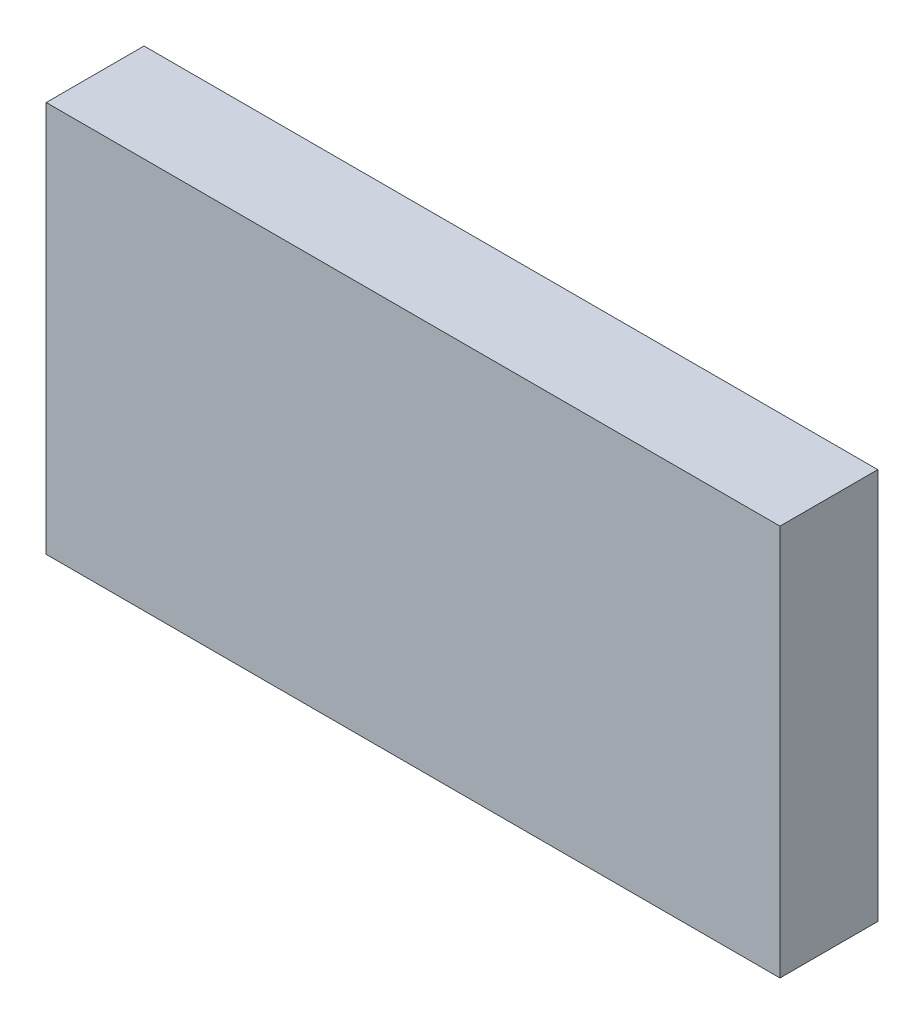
from build123d import *

# Parameters (mm, degrees)
SKIZZE1_W                       = 40
SKIZZE1_H                       = 160
AUFSATZ_LINEAR_AUSTRAGEN1_DEPTH = 150


with BuildPart() as part:
    # Skizze1 → Aufsatz-Linear austragen1 (new, symmetric)
    with BuildSketch(Plane(origin=(0, 0, 0), x_dir=(0, 0, -1), z_dir=(1, 0, 0))):
        with Locations((20, 80)):
            Rectangle(SKIZZE1_W, SKIZZE1_H)
    extrude(amount=AUFSATZ_LINEAR_AUSTRAGEN1_DEPTH, both=True)


solid = part.part
